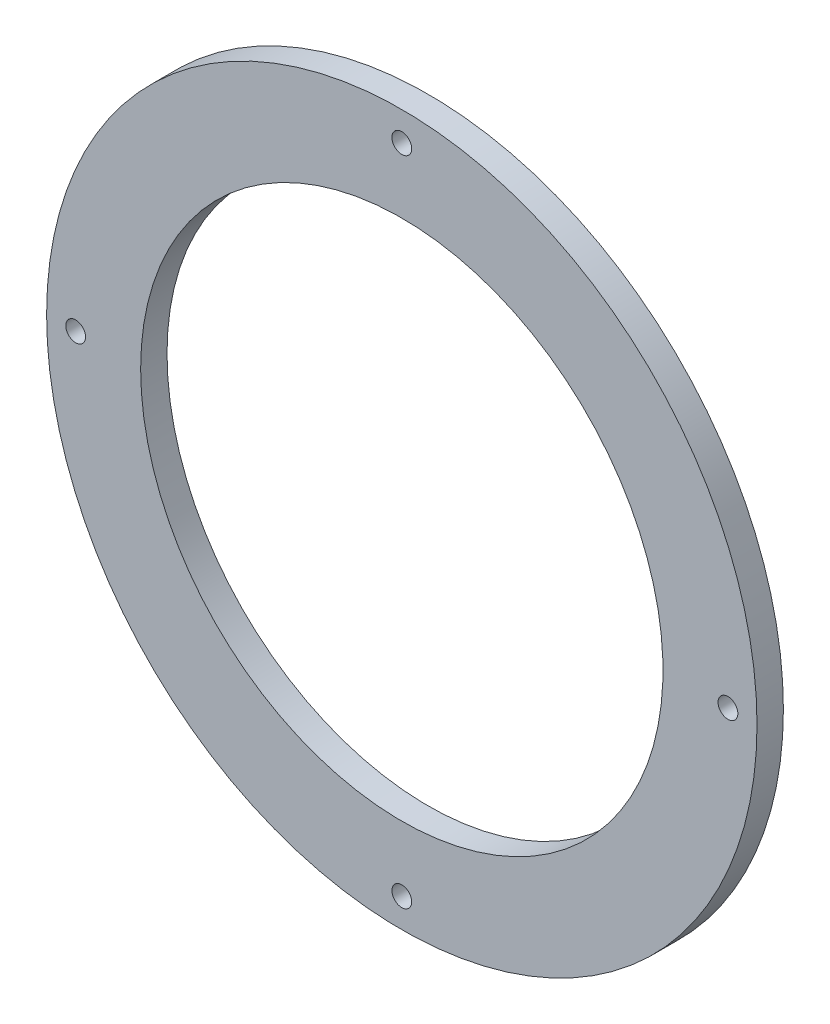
from build123d import *

# Parameters (mm, degrees)
SKETCH1_R           = 85.5
SKETCH1_R_2         = 2.38125
BOSS_EXTRUDE1_DEPTH = 6.35
SKETCH6_R           = 62.865
CUT_EXTRUDE3_DEPTH  = 122.081883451


with BuildPart() as part:
    # Sketch1 → Boss-Extrude1 (new body)
    with BuildSketch(Plane.XY):
        Circle(SKETCH1_R)
        with Locations((0, 78.499999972)):
            Circle(SKETCH1_R_2, mode=Mode.SUBTRACT)
        with Locations((78.5, 0)):
            Circle(SKETCH1_R_2, mode=Mode.SUBTRACT)
        with Locations((2.8e-08, -78.5)):
            Circle(SKETCH1_R_2, mode=Mode.SUBTRACT)
        with Locations((-78.499999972, -2.8e-08)):
            Circle(SKETCH1_R_2, mode=Mode.SUBTRACT)
    extrude(amount=BOSS_EXTRUDE1_DEPTH)

    # Sketch6 → Cut-Extrude3 (cut, through all)
    with BuildSketch(Plane(origin=(0, 0, 0), x_dir=(-1, 0, 0), z_dir=(0, 0, -1))):
        Circle(SKETCH6_R)
    extrude(amount=-CUT_EXTRUDE3_DEPTH, mode=Mode.SUBTRACT)


solid = part.part
